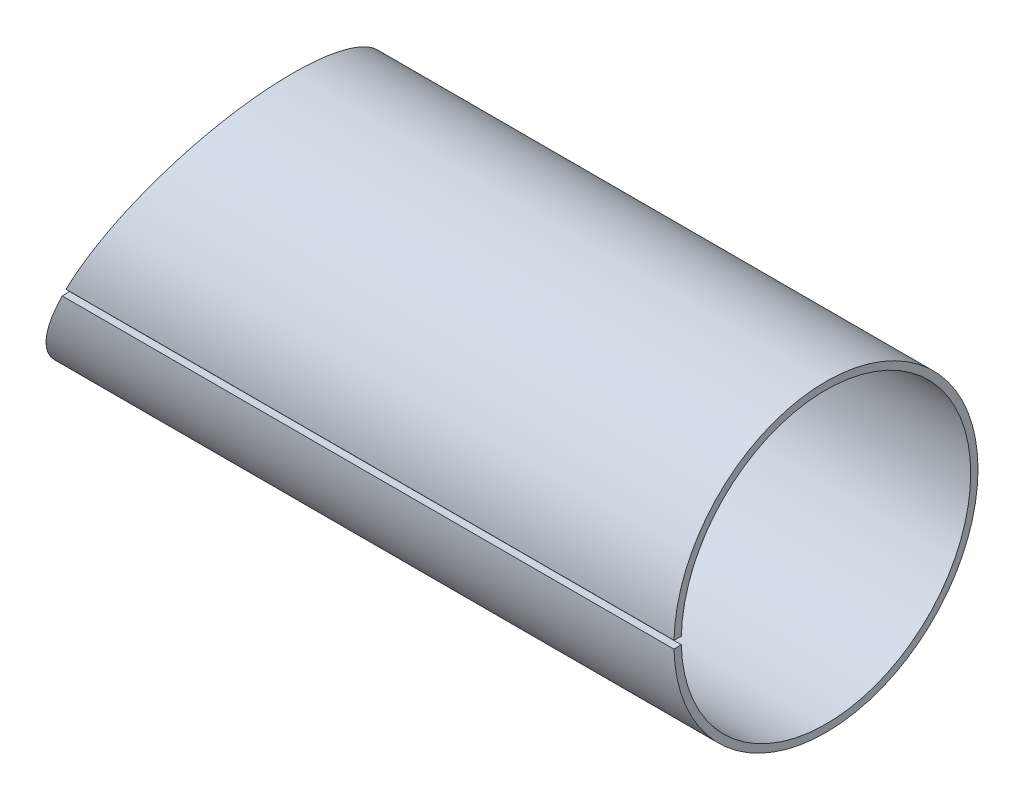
ISO-10303-21;
HEADER;
FILE_DESCRIPTION(('STEP AP214'),'2;1');
FILE_NAME('part.step','',(''),(''),'','','');
FILE_SCHEMA(('AUTOMOTIVE_DESIGN { 1 0 10303 214 1 1 1 1 }'));
ENDSEC;
DATA;
#1=APPLICATION_CONTEXT('core data for automotive mechanical design processes');
#2=APPLICATION_PROTOCOL_DEFINITION('international standard','automotive_design',2000,#1);
#3=PRODUCT_CONTEXT('',#1,'mechanical');
#4=PRODUCT('Part','Part','',(#3));
#5=PRODUCT_RELATED_PRODUCT_CATEGORY('part','',(#4));
#6=PRODUCT_DEFINITION_FORMATION('','',#4);
#7=PRODUCT_DEFINITION_CONTEXT('part definition',#1,'design');
#8=PRODUCT_DEFINITION('design','',#6,#7);
#9=PRODUCT_DEFINITION_SHAPE('','',#8);
#10=(LENGTH_UNIT() NAMED_UNIT(*) SI_UNIT(.MILLI.,.METRE.));
#11=(NAMED_UNIT(*) PLANE_ANGLE_UNIT() SI_UNIT($,.RADIAN.));
#12=(NAMED_UNIT(*) SI_UNIT($,.STERADIAN.) SOLID_ANGLE_UNIT());
#13=UNCERTAINTY_MEASURE_WITH_UNIT(LENGTH_MEASURE(1.E-05),#10,'distance_accuracy_value','');
#14=(GEOMETRIC_REPRESENTATION_CONTEXT(3) GLOBAL_UNCERTAINTY_ASSIGNED_CONTEXT((#13)) GLOBAL_UNIT_ASSIGNED_CONTEXT((#10,
#11,#12)) REPRESENTATION_CONTEXT('',''));
#15=CARTESIAN_POINT('',(0.,0.,0.));
#16=DIRECTION('',(0.,0.,1.));
#17=DIRECTION('',(1.,0.,0.));
#18=AXIS2_PLACEMENT_3D('',#15,#16,#17);
#19=CARTESIAN_POINT('',(83.3860984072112,0.,0.));
#20=DIRECTION('',(-1.,0.,0.));
#21=DIRECTION('',(0.,0.,1.));
#22=AXIS2_PLACEMENT_3D('',#19,#20,#21);
#23=PLANE('',#22);
#24=DIRECTION('',(0.,0.0252703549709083,0.999680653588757));
#25=VECTOR('',#24,1.);
#26=CARTESIAN_POINT('',(83.3860984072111,0.499999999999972,19.7797113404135));
#27=LINE('',#26,#25);
#28=CARTESIAN_POINT('',(83.3860984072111,0.499999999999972,19.7797113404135));
#29=VERTEX_POINT('',#28);
#30=CARTESIAN_POINT('',(83.3860984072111,0.52527035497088,20.7793919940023));
#31=VERTEX_POINT('',#30);
#32=EDGE_CURVE('E13',#29,#31,#27,.T.);
#33=ORIENTED_EDGE('',*,*,#32,.F.);
#34=CARTESIAN_POINT('',(83.3860984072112,0.,0.));
#35=DIRECTION('',(1.,0.,0.));
#36=DIRECTION('',(0.,0.,-1.));
#37=AXIS2_PLACEMENT_3D('',#34,#35,#36);
#38=CIRCLE('',#37,19.786029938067);
#39=CARTESIAN_POINT('',(83.3860984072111,-0.499999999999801,19.7797113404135));
#40=VERTEX_POINT('',#39);
#41=EDGE_CURVE('E79',#40,#29,#38,.T.);
#42=ORIENTED_EDGE('',*,*,#41,.F.);
#43=DIRECTION('',(0.,-0.0252703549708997,0.999680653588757));
#44=VECTOR('',#43,1.);
#45=CARTESIAN_POINT('',(83.3860984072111,-0.499999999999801,19.7797113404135));
#46=LINE('',#45,#44);
#47=CARTESIAN_POINT('',(83.3860984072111,-0.525270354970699,20.7793919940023));
#48=VERTEX_POINT('',#47);
#49=EDGE_CURVE('E48',#40,#48,#46,.T.);
#50=ORIENTED_EDGE('',*,*,#49,.T.);
#51=CARTESIAN_POINT('',(83.3860984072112,0.,0.));
#52=DIRECTION('',(1.,0.,0.));
#53=DIRECTION('',(0.,0.,-1.));
#54=AXIS2_PLACEMENT_3D('',#51,#52,#53);
#55=CIRCLE('',#54,20.786029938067);
#56=EDGE_CURVE('E81',#48,#31,#55,.T.);
#57=ORIENTED_EDGE('',*,*,#56,.T.);
#58=EDGE_LOOP('',(#33,#42,#50,#57));
#59=FACE_BOUND('',#58,.T.);
#60=ADVANCED_FACE('F36',(#59),#23,.F.);
#61=CARTESIAN_POINT('',(41.5612085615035,-0.499999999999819,19.7797113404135));
#62=DIRECTION('',(0.,-0.999680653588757,-0.0252703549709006));
#63=DIRECTION('',(1.,0.,0.));
#64=AXIS2_PLACEMENT_3D('',#61,#62,#63);
#65=PLANE('',#64);
#66=ORIENTED_EDGE('',*,*,#49,.F.);
#67=DIRECTION('',(1.,0.,0.));
#68=VECTOR('',#67,1.);
#69=CARTESIAN_POINT('',(-0.263681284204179,-0.499999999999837,19.7797113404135));
#70=LINE('',#69,#68);
#71=CARTESIAN_POINT('',(-0.263681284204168,-0.499999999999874,19.7797113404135));
#72=VERTEX_POINT('',#71);
#73=EDGE_CURVE('E88',#72,#40,#70,.T.);
#74=ORIENTED_EDGE('',*,*,#73,.F.);
#75=CARTESIAN_POINT('',(-0.263681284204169,-0.525270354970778,20.7793919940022));
#76=CARTESIAN_POINT('',(-0.263681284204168,-0.499999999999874,19.7797113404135));
#77=B_SPLINE_CURVE_WITH_KNOTS('',1,(#75,#76),.UNSPECIFIED.,.F.,.F.,(2,2),(0.,1.),.UNSPECIFIED.);
#78=CARTESIAN_POINT('',(-0.263681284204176,-0.525270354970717,20.7793919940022));
#79=VERTEX_POINT('',#78);
#80=EDGE_CURVE('E154',#72,#79,#77,.F.);
#81=ORIENTED_EDGE('',*,*,#80,.T.);
#82=DIRECTION('',(1.,0.,0.));
#83=VECTOR('',#82,1.);
#84=CARTESIAN_POINT('',(-154.998125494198,-0.525270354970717,20.7793919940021));
#85=LINE('',#84,#83);
#86=EDGE_CURVE('E95',#79,#48,#85,.T.);
#87=ORIENTED_EDGE('',*,*,#86,.T.);
#88=EDGE_LOOP('',(#66,#74,#81,#87));
#89=FACE_BOUND('',#88,.T.);
#90=ADVANCED_FACE('F126',(#89),#65,.F.);
#91=CARTESIAN_POINT('',(0.263681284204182,0.525270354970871,20.7793919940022));
#92=CARTESIAN_POINT('',(0.663519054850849,1.32182740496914,20.7592562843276));
#93=CARTESIAN_POINT('',(1.02061929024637,2.03411045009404,20.6959065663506));
#94=CARTESIAN_POINT('',(1.64972063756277,3.28722495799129,20.5341741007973));
#95=CARTESIAN_POINT('',(1.92165909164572,3.8281126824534,20.4358145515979));
#96=CARTESIAN_POINT('',(2.2083168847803,4.39910667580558,20.3155241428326));
#97=CARTESIAN_POINT('',(2.26437491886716,4.51079887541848,20.2910022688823));
#98=CARTESIAN_POINT('',(2.37612709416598,4.73345775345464,20.2402188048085));
#99=CARTESIAN_POINT('',(2.43147625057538,4.84374487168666,20.2140997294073));
#100=CARTESIAN_POINT('',(2.59594292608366,5.17146397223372,20.1336933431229));
#101=CARTESIAN_POINT('',(2.70347965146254,5.3857525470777,20.0773576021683));
#102=CARTESIAN_POINT('',(3.01976665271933,6.01596674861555,19.9011933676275));
#103=CARTESIAN_POINT('',(3.22219375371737,6.41922512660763,19.7742204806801));
#104=CARTESIAN_POINT('',(3.6101861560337,7.1919656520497,19.5064573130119));
#105=CARTESIAN_POINT('',(3.79575145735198,7.5614512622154,19.3656678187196));
#106=CARTESIAN_POINT('',(4.1500202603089,8.2671076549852,19.0751033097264));
#107=CARTESIAN_POINT('',(4.32138172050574,8.60855514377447,18.9232088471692));
#108=CARTESIAN_POINT('',(4.82268316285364,9.60735896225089,18.4472694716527));
#109=CARTESIAN_POINT('',(5.13790458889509,10.2352759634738,18.104582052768));
#110=CARTESIAN_POINT('',(5.58226742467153,11.1203411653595,17.5646373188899));
#111=CARTESIAN_POINT('',(5.72528860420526,11.4052380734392,17.3807969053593));
#112=CARTESIAN_POINT('',(6.00380039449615,11.9601176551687,17.0037390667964));
#113=CARTESIAN_POINT('',(6.13939615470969,12.2302761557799,16.8103403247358));
#114=CARTESIAN_POINT('',(6.53520303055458,13.0188000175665,16.2173521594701));
#115=CARTESIAN_POINT('',(6.78443374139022,13.5151771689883,15.8049930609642));
#116=CARTESIAN_POINT('',(7.2536140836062,14.4496927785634,14.9554069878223));
#117=CARTESIAN_POINT('',(7.47328513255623,14.8874708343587,14.5188186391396));
#118=CARTESIAN_POINT('',(7.88871610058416,15.7151409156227,13.6186353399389));
#119=CARTESIAN_POINT('',(8.08383213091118,16.1037564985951,13.1560971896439));
#120=CARTESIAN_POINT('',(8.44886528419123,16.8307472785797,12.2122812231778));
#121=CARTESIAN_POINT('',(8.61842621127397,17.1685352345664,11.7319806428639));
#122=CARTESIAN_POINT('',(8.93447333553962,17.79828726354,10.7526249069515));
#123=CARTESIAN_POINT('',(9.08096612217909,18.0901613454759,10.2534742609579));
#124=CARTESIAN_POINT('',(9.35089014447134,18.62779994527,9.24081928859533));
#125=CARTESIAN_POINT('',(9.47432138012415,18.8735657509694,8.7273161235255));
#126=CARTESIAN_POINT('',(9.69812230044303,19.3193126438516,7.6903634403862));
#127=CARTESIAN_POINT('',(9.79879639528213,19.5200968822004,7.16515442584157));
#128=CARTESIAN_POINT('',(10.0678942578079,20.0570853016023,5.57051958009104));
#129=CARTESIAN_POINT('',(10.20307630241,20.3269719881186,4.48394742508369));
#130=CARTESIAN_POINT('',(10.3850073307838,20.6889471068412,2.29326019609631));
#131=CARTESIAN_POINT('',(10.4317563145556,20.7810474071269,1.18917022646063));
#132=CARTESIAN_POINT('',(10.4355549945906,20.7882254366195,-0.45877873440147));
#133=CARTESIAN_POINT('',(10.4257914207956,20.7688920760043,-1.00726015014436));
#134=CARTESIAN_POINT('',(10.3844381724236,20.6865797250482,-2.1040129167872));
#135=CARTESIAN_POINT('',(10.3528155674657,20.6235875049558,-2.65158975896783));
#136=CARTESIAN_POINT('',(10.2251098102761,20.3691067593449,-4.28666856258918));
#137=CARTESIAN_POINT('',(10.0962994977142,20.1126399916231,-5.36564871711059));
#138=CARTESIAN_POINT('',(9.8359643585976,19.594085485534,-6.96011586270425));
#139=CARTESIAN_POINT('',(9.73805641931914,19.3989975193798,-7.48705586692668));
#140=CARTESIAN_POINT('',(9.51998142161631,18.9644705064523,-8.5279521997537));
#141=CARTESIAN_POINT('',(9.39985555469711,18.7251824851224,-9.04178004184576));
#142=CARTESIAN_POINT('',(9.13593136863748,18.1995708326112,-10.0579255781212));
#143=CARTESIAN_POINT('',(8.99230767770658,17.9135195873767,-10.5595161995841));
#144=CARTESIAN_POINT('',(8.68173710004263,17.2947823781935,-11.545045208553));
#145=CARTESIAN_POINT('',(8.51512940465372,16.9627332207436,-12.0281586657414));
#146=CARTESIAN_POINT('',(7.97778769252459,15.892378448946,-13.449864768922));
#147=CARTESIAN_POINT('',(7.56830328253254,15.0768611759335,-14.3638329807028));
#148=CARTESIAN_POINT('',(6.64682125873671,13.2407573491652,-16.0721431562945));
#149=CARTESIAN_POINT('',(6.12578866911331,12.203206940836,-16.8822935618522));
#150=CARTESIAN_POINT('',(5.2532861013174,10.4650061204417,-17.9724915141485));
#151=CARTESIAN_POINT('',(4.94315623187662,9.84740762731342,-18.3201010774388));
#152=CARTESIAN_POINT('',(4.44757139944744,8.86007478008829,-18.8067206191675));
#153=CARTESIAN_POINT('',(4.2773903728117,8.52098109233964,-18.9630166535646));
#154=CARTESIAN_POINT('',(4.01463970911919,7.99746326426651,-19.1868611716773));
#155=CARTESIAN_POINT('',(3.92580963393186,7.82047928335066,-19.2597086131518));
#156=CARTESIAN_POINT('',(3.74565644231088,7.46159046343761,-19.4015705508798));
#157=CARTESIAN_POINT('',(3.6541651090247,7.27936388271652,-19.4707413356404));
#158=CARTESIAN_POINT('',(3.18293730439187,6.34093869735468,-19.8113451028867));
#159=CARTESIAN_POINT('',(2.76773411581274,5.51396067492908,-20.0627491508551));
#160=CARTESIAN_POINT('',(2.20095394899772,4.38453639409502,-20.3196590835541));
#161=CARTESIAN_POINT('',(2.08520910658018,4.15389133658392,-20.3681531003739));
#162=CARTESIAN_POINT('',(1.93754204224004,3.85969686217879,-20.4246265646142));
#163=CARTESIAN_POINT('',(1.90817578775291,3.80118784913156,-20.4356016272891));
#164=CARTESIAN_POINT('',(1.84726409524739,3.67987479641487,-20.4577947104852));
#165=CARTESIAN_POINT('',(1.81570937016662,3.6170510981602,-20.4690091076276));
#166=CARTESIAN_POINT('',(1.71774855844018,3.42205517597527,-20.502828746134));
#167=CARTESIAN_POINT('',(1.64804583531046,3.28335741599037,-20.5256145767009));
#168=CARTESIAN_POINT('',(1.27755464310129,2.54608736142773,-20.6381313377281));
#169=CARTESIAN_POINT('',(0.910833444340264,1.81562061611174,-20.7249445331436));
#170=CARTESIAN_POINT('',(0.364521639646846,0.726474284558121,-20.7744752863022));
#171=CARTESIAN_POINT('',(0.250863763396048,0.499882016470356,-20.7813501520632));
#172=CARTESIAN_POINT('',(0.0737836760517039,0.146994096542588,-20.785843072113));
#173=CARTESIAN_POINT('',(0.0129622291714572,0.0258358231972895,-20.7863585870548));
#174=CARTESIAN_POINT('',(-0.10720413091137,-0.213579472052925,-20.7852773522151));
#175=CARTESIAN_POINT('',(-0.166192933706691,-0.331138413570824,-20.7837126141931));
#176=CARTESIAN_POINT('',(-0.455665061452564,-0.908112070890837,-20.7713149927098));
#177=CARTESIAN_POINT('',(-0.669732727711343,-1.33500490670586,-20.7468387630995));
#178=CARTESIAN_POINT('',(-1.25940561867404,-2.5101852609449,-20.6488758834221));
#179=CARTESIAN_POINT('',(-1.58248073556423,-3.15272028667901,-20.5519173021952));
#180=CARTESIAN_POINT('',(-1.86714508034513,-3.71948433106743,-20.4506373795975));
#181=CARTESIAN_POINT('',(-1.89740042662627,-3.77974495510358,-20.439575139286));
#182=CARTESIAN_POINT('',(-1.95712025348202,-3.89871122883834,-20.417217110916));
#183=CARTESIAN_POINT('',(-1.98682999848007,-3.95789910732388,-20.4058246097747));
#184=CARTESIAN_POINT('',(-2.07550872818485,-4.13457395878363,-20.371027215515));
#185=CARTESIAN_POINT('',(-2.13402720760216,-4.25117204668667,-20.3470024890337));
#186=CARTESIAN_POINT('',(-2.30778062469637,-4.59739051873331,-20.2726114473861));
#187=CARTESIAN_POINT('',(-2.42121354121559,-4.82343361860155,-20.2199292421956));
#188=CARTESIAN_POINT('',(-2.75430420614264,-5.48714870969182,-20.0538843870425));
#189=CARTESIAN_POINT('',(-2.96675386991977,-5.91038648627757,-19.9325403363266));
#190=CARTESIAN_POINT('',(-3.37243163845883,-6.7183481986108,-19.6749238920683));
#191=CARTESIAN_POINT('',(-3.56565974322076,-7.10307702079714,-19.5386525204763));
#192=CARTESIAN_POINT('',(-3.93289439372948,-7.83457653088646,-19.2570001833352));
#193=CARTESIAN_POINT('',(-4.11101290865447,-8.18950128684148,-19.1084939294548));
#194=CARTESIAN_POINT('',(-4.63094348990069,-9.225475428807,-18.6419786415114));
#195=CARTESIAN_POINT('',(-4.95742214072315,-9.87583888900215,-18.3037206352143));
#196=CARTESIAN_POINT('',(-5.41692751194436,-10.7910399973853,-17.7689991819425));
#197=CARTESIAN_POINT('',(-5.56471057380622,-11.0854055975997,-17.5866575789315));
#198=CARTESIAN_POINT('',(-5.85301592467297,-11.6597501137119,-17.2112454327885));
#199=CARTESIAN_POINT('',(-5.99331721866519,-11.9392632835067,-17.0183975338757));
#200=CARTESIAN_POINT('',(-6.40266695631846,-12.7547181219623,-16.4264266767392));
#201=CARTESIAN_POINT('',(-6.66016125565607,-13.2675340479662,-16.0139024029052));
#202=CARTESIAN_POINT('',(-7.02329441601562,-13.9908988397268,-15.3758629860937));
#203=CARTESIAN_POINT('',(-7.14032336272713,-14.2241014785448,-15.1602629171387));
#204=CARTESIAN_POINT('',(-7.36801001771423,-14.677782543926,-14.7214582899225));
#205=CARTESIAN_POINT('',(-7.47856107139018,-14.8980477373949,-14.4984157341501));
#206=CARTESIAN_POINT('',(-7.80033741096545,-15.5390763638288,-13.8196788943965));
#207=CARTESIAN_POINT('',(-8.00168587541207,-15.9400493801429,-13.3543892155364));
#208=CARTESIAN_POINT('',(-8.37804461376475,-16.6896171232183,-12.4049008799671));
#209=CARTESIAN_POINT('',(-8.55277250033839,-17.0378163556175,-11.9214660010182));
#210=CARTESIAN_POINT('',(-8.87901380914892,-17.6878517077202,-10.9338209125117));
#211=CARTESIAN_POINT('',(-9.03019674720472,-17.9890098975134,-10.4303519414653));
#212=CARTESIAN_POINT('',(-9.44793241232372,-18.8209640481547,-8.89837431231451));
#213=CARTESIAN_POINT('',(-9.67831114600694,-19.2800001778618,-7.85012327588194));
#214=CARTESIAN_POINT('',(-9.95654956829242,-19.8342887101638,-6.24347518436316));
#215=CARTESIAN_POINT('',(-10.0379064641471,-19.9962971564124,-5.7028276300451));
#216=CARTESIAN_POINT('',(-10.1778417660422,-20.2749440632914,-4.61527747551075));
#217=CARTESIAN_POINT('',(-10.2364092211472,-20.3916217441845,-4.06848643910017));
#218=CARTESIAN_POINT('',(-10.378686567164,-20.6751457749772,-2.41754058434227));
#219=CARTESIAN_POINT('',(-10.4287234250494,-20.7746907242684,-1.30539621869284));
#220=CARTESIAN_POINT('',(-10.4391801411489,-20.7955372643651,0.915130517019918));
#221=CARTESIAN_POINT('',(-10.3996307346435,-20.7168325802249,2.02880535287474));
#222=CARTESIAN_POINT('',(-10.273139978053,-20.4647690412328,3.68283984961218));
#223=CARTESIAN_POINT('',(-10.2198225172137,-20.3585833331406,4.23100499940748));
#224=CARTESIAN_POINT('',(-10.0904248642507,-20.1009304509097,5.32220947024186));
#225=CARTESIAN_POINT('',(-10.0143797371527,-19.9494852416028,5.86485931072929));
#226=CARTESIAN_POINT('',(-9.75220545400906,-19.4271617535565,7.47812870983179));
#227=CARTESIAN_POINT('',(-9.53253652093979,-18.9895424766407,8.53209948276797));
#228=CARTESIAN_POINT('',(-9.13150895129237,-18.1908092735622,10.0741550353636));
#229=CARTESIAN_POINT('',(-8.986020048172,-17.9009637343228,10.5811314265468));
#230=CARTESIAN_POINT('',(-8.67141614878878,-17.2741157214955,11.576258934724));
#231=CARTESIAN_POINT('',(-8.50248292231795,-16.9375396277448,12.0639968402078));
#232=CARTESIAN_POINT('',(-8.13827184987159,-16.2121701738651,13.0225115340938));
#233=CARTESIAN_POINT('',(-7.94330893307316,-15.8238694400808,13.4923979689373));
#234=CARTESIAN_POINT('',(-7.52766833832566,-14.9958064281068,14.407131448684));
#235=CARTESIAN_POINT('',(-7.30770867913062,-14.5574459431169,14.8507567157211));
#236=CARTESIAN_POINT('',(-6.83779396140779,-13.6214763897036,15.7136752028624));
#237=CARTESIAN_POINT('',(-6.58782496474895,-13.1236716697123,16.132843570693));
#238=CARTESIAN_POINT('',(-6.19035401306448,-12.331851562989,16.7360260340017));
#239=CARTESIAN_POINT('',(-6.05411078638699,-12.0604021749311,16.9328192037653));
#240=CARTESIAN_POINT('',(-5.77411851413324,-11.5025439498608,17.3166148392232));
#241=CARTESIAN_POINT('',(-5.63051188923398,-11.2164391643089,17.50348504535));
#242=CARTESIAN_POINT('',(-5.18387679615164,-10.3268238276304,18.0527441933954));
#243=CARTESIAN_POINT('',(-4.8665026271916,-9.69467069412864,18.4018447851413));
#244=CARTESIAN_POINT('',(-4.36101521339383,-8.68753284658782,18.8871566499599));
#245=CARTESIAN_POINT('',(-4.18765267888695,-8.34209640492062,19.042493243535));
#246=CARTESIAN_POINT('',(-3.83096780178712,-7.63155275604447,19.338214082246));
#247=CARTESIAN_POINT('',(-3.64392060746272,-7.25911503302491,19.4816558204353));
#248=CARTESIAN_POINT('',(-3.05666475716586,-6.08953996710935,19.8911799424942));
#249=CARTESIAN_POINT('',(-2.63034183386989,-5.2398300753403,20.1366636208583));
#250=CARTESIAN_POINT('',(-1.93862891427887,-3.86188428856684,20.4295225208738));
#251=CARTESIAN_POINT('',(-1.66486986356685,-3.31739444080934,20.5295128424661));
#252=CARTESIAN_POINT('',(-1.02969732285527,-2.05220929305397,20.6943093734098));
#253=CARTESIAN_POINT('',(-0.668562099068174,-1.3318718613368,20.759002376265));
#254=CARTESIAN_POINT('',(-0.263681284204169,-0.525270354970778,20.7793919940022));
#255=CARTESIAN_POINT('',(0.263681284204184,0.499999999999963,19.7797113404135));
#256=CARTESIAN_POINT('',(0.663517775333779,1.25823287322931,19.7605444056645));
#257=CARTESIAN_POINT('',(1.02061929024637,1.93625095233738,19.7002423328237));
#258=CARTESIAN_POINT('',(1.64972063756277,3.12907907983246,19.5462906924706));
#259=CARTESIAN_POINT('',(1.92165909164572,3.64394510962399,19.4526631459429));
#260=CARTESIAN_POINT('',(2.2083168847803,4.18746901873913,19.3381598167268));
#261=CARTESIAN_POINT('',(2.26437491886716,4.29378779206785,19.3148176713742));
#262=CARTESIAN_POINT('',(2.37612709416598,4.5057347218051,19.2664773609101));
#263=CARTESIAN_POINT('',(2.43147625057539,4.61071601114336,19.2416148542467));
#264=CARTESIAN_POINT('',(2.59594292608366,4.92266879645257,19.1650767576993));
#265=CARTESIAN_POINT('',(2.70347965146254,5.12664811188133,19.1114512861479));
#266=CARTESIAN_POINT('',(3.01976665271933,5.72654319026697,18.9437621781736));
#267=CARTESIAN_POINT('',(3.22219375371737,6.11040111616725,18.8228978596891));
#268=CARTESIAN_POINT('',(3.6101861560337,6.84596568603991,18.5680165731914));
#269=CARTESIAN_POINT('',(3.79575145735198,7.19767562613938,18.4340003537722));
#270=CARTESIAN_POINT('',(4.1500202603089,7.86938342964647,18.1574146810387));
#271=CARTESIAN_POINT('',(4.32138172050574,8.19440414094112,18.0128277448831));
#272=CARTESIAN_POINT('',(4.82268316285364,9.14515627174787,17.5597854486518));
#273=CARTESIAN_POINT('',(5.13790458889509,9.74286466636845,17.2335844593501));
#274=CARTESIAN_POINT('',(5.58226742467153,10.5853500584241,16.719616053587));
#275=CARTESIAN_POINT('',(5.72528860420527,10.8565407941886,16.5446200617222));
#276=CARTESIAN_POINT('',(6.00380039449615,11.3847255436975,16.1857021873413));
#277=CARTESIAN_POINT('',(6.1393961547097,11.6418869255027,16.0016077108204));
#278=CARTESIAN_POINT('',(6.53520303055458,12.3924755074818,15.4371477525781));
#279=CARTESIAN_POINT('',(6.78443374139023,12.8649723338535,15.0446269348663));
#280=CARTESIAN_POINT('',(7.2536140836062,13.7545291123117,14.2359137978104));
#281=CARTESIAN_POINT('',(7.47328513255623,14.1712460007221,13.8203293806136));
#282=CARTESIAN_POINT('',(7.88871610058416,14.9590975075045,12.9634532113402));
#283=CARTESIAN_POINT('',(8.08383213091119,15.3290170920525,12.5231674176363));
#284=CARTESIAN_POINT('',(8.44886528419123,16.0210329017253,11.6247577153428));
#285=CARTESIAN_POINT('',(8.61842621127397,16.3425701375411,11.1675640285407));
#286=CARTESIAN_POINT('',(8.93447333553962,16.942025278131,10.2353243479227));
#287=CARTESIAN_POINT('',(9.08096612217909,17.2198575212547,9.7601874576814));
#288=CARTESIAN_POINT('',(9.35089014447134,17.7316307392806,8.79625054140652));
#289=CARTESIAN_POINT('',(9.47432138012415,17.9655729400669,8.30745162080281));
#290=CARTESIAN_POINT('',(9.69812230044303,18.3898752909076,7.32038593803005));
#291=CARTESIAN_POINT('',(9.79879639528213,18.5809999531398,6.82044432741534));
#292=CARTESIAN_POINT('',(10.0678942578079,19.0921542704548,5.30252614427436));
#293=CARTESIAN_POINT('',(10.20307630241,19.3490569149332,4.26822814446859));
#294=CARTESIAN_POINT('',(10.3850073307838,19.6936176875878,2.18293320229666));
#295=CARTESIAN_POINT('',(10.4317563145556,19.7812871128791,1.13196015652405));
#296=CARTESIAN_POINT('',(10.4355549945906,19.7881198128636,-0.436707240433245));
#297=CARTESIAN_POINT('',(10.4257914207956,19.7697165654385,-0.958801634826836));
#298=CARTESIAN_POINT('',(10.3844381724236,19.6913641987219,-2.00279046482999));
#299=CARTESIAN_POINT('',(10.3528155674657,19.6314024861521,-2.52402380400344));
#300=CARTESIAN_POINT('',(10.2251098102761,19.3891646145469,-4.08044021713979));
#301=CARTESIAN_POINT('',(10.0962994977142,19.1450362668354,-5.10751146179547));
#302=CARTESIAN_POINT('',(9.8359643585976,18.6514290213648,-6.62527001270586));
#303=CARTESIAN_POINT('',(9.73805641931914,18.4657265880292,-7.12685933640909));
#304=CARTESIAN_POINT('',(9.51998142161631,18.0521043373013,-8.11767894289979));
#305=CARTESIAN_POINT('',(9.39985555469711,17.8243282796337,-8.60678692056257));
#306=CARTESIAN_POINT('',(9.13593136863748,17.3240034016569,-9.57404647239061));
#307=CARTESIAN_POINT('',(8.99230767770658,17.0517138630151,-10.0515059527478));
#308=CARTESIAN_POINT('',(8.68173710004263,16.4627436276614,-10.9896219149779));
#309=CARTESIAN_POINT('',(8.51512940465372,16.1466691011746,-11.4494931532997));
#310=CARTESIAN_POINT('',(7.97778769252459,15.1278082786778,-12.8028020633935));
#311=CARTESIAN_POINT('',(7.56830328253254,14.3515249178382,-13.6727999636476));
#312=CARTESIAN_POINT('',(6.64682125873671,12.603754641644,-15.2989246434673));
#313=CARTESIAN_POINT('',(6.12578866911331,11.6161199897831,-16.07009933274));
#314=CARTESIAN_POINT('',(5.25328610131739,9.96154268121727,-17.1078486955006));
#315=CARTESIAN_POINT('',(4.94315623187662,9.37365637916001,-17.4387350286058));
#316=CARTESIAN_POINT('',(4.44757139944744,8.43382335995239,-17.9019436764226));
#317=CARTESIAN_POINT('',(4.2773903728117,8.11104321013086,-18.0507204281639));
#318=CARTESIAN_POINT('',(4.01463970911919,7.61271142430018,-18.2637959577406));
#319=CARTESIAN_POINT('',(3.92580963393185,7.4442420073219,-18.3331387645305));
#320=CARTESIAN_POINT('',(3.74565644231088,7.10261905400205,-18.4681758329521));
#321=CARTESIAN_POINT('',(3.6541651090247,6.92915925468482,-18.5340188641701));
#322=CARTESIAN_POINT('',(3.18293730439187,6.03588098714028,-18.8582364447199));
#323=CARTESIAN_POINT('',(2.76773411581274,5.24868824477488,-19.0975456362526));
#324=CARTESIAN_POINT('',(2.20095394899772,4.17359970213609,-19.3420958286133));
#325=CARTESIAN_POINT('',(2.08520910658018,3.95405080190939,-19.3882568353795));
#326=CARTESIAN_POINT('',(1.93754204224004,3.67400979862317,-19.4420134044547));
#327=CARTESIAN_POINT('',(1.9081757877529,3.61831560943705,-19.4524604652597));
#328=CARTESIAN_POINT('',(1.84726409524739,3.50283883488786,-19.4735858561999));
#329=CARTESIAN_POINT('',(1.81570937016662,3.44303753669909,-19.4842607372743));
#330=CARTESIAN_POINT('',(1.71774855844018,3.25742271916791,-19.5164533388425));
#331=CARTESIAN_POINT('',(1.64804583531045,3.12539760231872,-19.5381429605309));
#332=CARTESIAN_POINT('',(1.27755464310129,2.4235970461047,-19.645246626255));
#333=CARTESIAN_POINT('',(0.910833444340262,1.72827249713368,-19.7278833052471));
#334=CARTESIAN_POINT('',(0.364521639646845,0.69152416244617,-19.7750311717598));
#335=CARTESIAN_POINT('',(0.250863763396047,0.475833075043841,-19.7815752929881));
#336=CARTESIAN_POINT('',(0.0737836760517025,0.139922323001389,-19.7858520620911));
#337=CARTESIAN_POINT('',(0.0129622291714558,0.024592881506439,-19.7863427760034));
#338=CARTESIAN_POINT('',(-0.107204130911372,-0.203304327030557,-19.7853135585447));
#339=CARTESIAN_POINT('',(-0.166192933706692,-0.315207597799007,-19.783824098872));
#340=CARTESIAN_POINT('',(-0.455665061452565,-0.864423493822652,-19.7720229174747));
#341=CARTESIAN_POINT('',(-0.669732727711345,-1.27077884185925,-19.7487242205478));
#342=CARTESIAN_POINT('',(-1.25940561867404,-2.38942216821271,-19.6554742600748));
#343=CARTESIAN_POINT('',(-1.58248073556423,-3.00104532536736,-19.563180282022));
#344=CARTESIAN_POINT('',(-1.86714508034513,-3.54054278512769,-19.4667728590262));
#345=CARTESIAN_POINT('',(-1.89740042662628,-3.59790431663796,-19.456242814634));
#346=CARTESIAN_POINT('',(-1.95712025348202,-3.71114721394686,-19.434960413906));
#347=CARTESIAN_POINT('',(-1.98682999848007,-3.76748760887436,-19.4241159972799));
#348=CARTESIAN_POINT('',(-2.07550872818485,-3.93566276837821,-19.3909926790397));
#349=CARTESIAN_POINT('',(-2.13402720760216,-4.04665141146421,-19.3681237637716));
#350=CARTESIAN_POINT('',(-2.30778062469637,-4.37621357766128,-19.2973116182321));
#351=CARTESIAN_POINT('',(-2.42121354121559,-4.59138191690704,-19.2471639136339));
#352=CARTESIAN_POINT('',(-2.75430420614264,-5.22316618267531,-19.0891073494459));
#353=CARTESIAN_POINT('',(-2.96675386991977,-5.62604231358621,-18.9736010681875));
#354=CARTESIAN_POINT('',(-3.37243163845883,-6.39513360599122,-18.7283783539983));
#355=CARTESIAN_POINT('',(-3.56565974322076,-6.76135341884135,-18.5986628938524));
#356=CARTESIAN_POINT('',(-3.93289439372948,-7.45766104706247,-18.3305606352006));
#357=CARTESIAN_POINT('',(-4.11101290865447,-7.79551064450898,-18.1891989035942));
#358=CARTESIAN_POINT('',(-4.63094348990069,-8.7816448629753,-17.7451273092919));
#359=CARTESIAN_POINT('',(-4.95742214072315,-9.40071983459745,-17.4231426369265));
#360=CARTESIAN_POINT('',(-5.41692751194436,-10.2718913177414,-16.9141462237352));
#361=CARTESIAN_POINT('',(-5.56471057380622,-10.5520952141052,-16.7405769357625));
#362=CARTESIAN_POINT('',(-5.85301592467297,-11.0988084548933,-16.383225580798));
#363=CARTESIAN_POINT('',(-5.99331721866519,-11.3648744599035,-16.1996554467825));
#364=CARTESIAN_POINT('',(-6.40266695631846,-12.1410983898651,-15.6361638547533));
#365=CARTESIAN_POINT('',(-6.66016125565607,-12.6292431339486,-15.2434858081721));
#366=CARTESIAN_POINT('',(-7.02329441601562,-13.3178073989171,-14.6361419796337));
#367=CARTESIAN_POINT('',(-7.14032336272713,-13.5397908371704,-14.4309142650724));
#368=CARTESIAN_POINT('',(-7.36801001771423,-13.9716456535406,-14.013220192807));
#369=CARTESIAN_POINT('',(-7.47856107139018,-14.181314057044,-13.8009080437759));
#370=CARTESIAN_POINT('',(-7.80033741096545,-14.7915032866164,-13.1548247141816));
#371=CARTESIAN_POINT('',(-8.00168587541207,-15.1731857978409,-12.7119197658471));
#372=CARTESIAN_POINT('',(-8.37804461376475,-15.8866924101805,-11.8081105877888));
#373=CARTESIAN_POINT('',(-8.55277250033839,-16.2181400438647,-11.3479333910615));
#374=CARTESIAN_POINT('',(-8.87901380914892,-16.8369026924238,-10.4078031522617));
#375=CARTESIAN_POINT('',(-9.03019674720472,-17.1235723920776,-9.9285556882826));
#376=CARTESIAN_POINT('',(-9.44793241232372,-17.9155018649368,-8.47028033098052));
#377=CARTESIAN_POINT('',(-9.67831114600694,-18.3524541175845,-7.47245985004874));
#378=CARTESIAN_POINT('',(-9.95654956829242,-18.8800762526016,-5.94310636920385));
#379=CARTESIAN_POINT('',(-10.0379064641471,-19.03429059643,-5.42846895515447));
#380=CARTESIAN_POINT('',(-10.1778417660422,-19.2995320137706,-4.39324000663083));
#381=CARTESIAN_POINT('',(-10.2364092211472,-19.4105964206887,-3.87275466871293));
#382=CARTESIAN_POINT('',(-10.378686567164,-19.6804803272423,-2.30123455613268));
#383=CARTESIAN_POINT('',(-10.4287234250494,-19.7752362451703,-1.24259460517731));
#384=CARTESIAN_POINT('',(-10.4391801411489,-19.7950798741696,0.871104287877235));
#385=CARTESIAN_POINT('',(-10.3996307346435,-19.720161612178,1.93120107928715));
#386=CARTESIAN_POINT('',(-10.273139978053,-19.4802246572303,3.50566124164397));
#387=CARTESIAN_POINT('',(-10.2198225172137,-19.3791474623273,4.02745458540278));
#388=CARTESIAN_POINT('',(-10.0904248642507,-19.1338900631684,5.06616204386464));
#389=CARTESIAN_POINT('',(-10.0143797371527,-18.989730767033,5.58270541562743));
#390=CARTESIAN_POINT('',(-9.75220545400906,-18.492535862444,7.11836165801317));
#391=CARTESIAN_POINT('',(-9.53253652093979,-18.0759701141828,8.12162670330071));
#392=CARTESIAN_POINT('',(-9.13150895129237,-17.3156633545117,9.58949514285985));
#393=CARTESIAN_POINT('',(-8.986020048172,-17.039762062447,10.0720812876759));
#394=CARTESIAN_POINT('',(-8.67141614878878,-16.443071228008,11.0193339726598));
#395=CARTESIAN_POINT('',(-8.50248292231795,-16.1226875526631,11.483607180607));
#396=CARTESIAN_POINT('',(-8.13827184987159,-15.4322150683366,12.3960084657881));
#397=CARTESIAN_POINT('',(-7.94330893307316,-15.0625951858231,12.8432890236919));
#398=CARTESIAN_POINT('',(-7.52766833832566,-14.2743696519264,13.7140153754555));
#399=CARTESIAN_POINT('',(-7.30770867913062,-13.8570983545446,14.1362981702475));
#400=CARTESIAN_POINT('',(-6.83779396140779,-12.966157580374,14.957702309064));
#401=CARTESIAN_POINT('',(-6.58782496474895,-12.4923018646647,15.356704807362));
#402=CARTESIAN_POINT('',(-6.19035401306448,-11.7385756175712,15.9308686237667));
#403=CARTESIAN_POINT('',(-6.05411078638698,-11.4801854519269,16.1181942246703));
#404=CARTESIAN_POINT('',(-5.77411851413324,-10.9491653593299,16.4835257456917));
#405=CARTESIAN_POINT('',(-5.63051188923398,-10.6768248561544,16.6614057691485));
#406=CARTESIAN_POINT('',(-5.18387679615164,-9.83000823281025,17.1842404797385));
#407=CARTESIAN_POINT('',(-4.8665026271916,-9.22826750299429,17.5165461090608));
#408=CARTESIAN_POINT('',(-4.36101521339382,-8.26958228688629,17.9785099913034));
#409=CARTESIAN_POINT('',(-4.18765267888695,-7.94076452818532,18.1263734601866));
#410=CARTESIAN_POINT('',(-3.83096780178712,-7.26440459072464,18.4078673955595));
#411=CARTESIAN_POINT('',(-3.64392060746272,-6.90988456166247,18.5444082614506));
#412=CARTESIAN_POINT('',(-3.05666475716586,-5.79657685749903,18.9342304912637));
#413=CARTESIAN_POINT('',(-2.63034183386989,-4.98774585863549,19.167904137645));
#414=CARTESIAN_POINT('',(-1.93862891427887,-3.67609198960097,19.4466738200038));
#415=CARTESIAN_POINT('',(-1.66486986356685,-3.15779713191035,19.5418536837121));
#416=CARTESIAN_POINT('',(-1.02969732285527,-1.95347907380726,19.6987219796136));
#417=CARTESIAN_POINT('',(-0.668560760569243,-1.2677939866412,19.7603027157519));
#418=CARTESIAN_POINT('',(-0.263681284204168,-0.499999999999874,19.7797113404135));
#419=B_SPLINE_SURFACE_WITH_KNOTS('',1,3,((#91,#92,#93,#94,#95,#96,#97,#98,#99,#100,#101,#102,
#103,#104,#105,#106,#107,#108,#109,#110,#111,#112,#113,#114,#115,#116,#117,#118,#119,#120,#121,
#122,#123,#124,#125,#126,#127,#128,#129,#130,#131,#132,#133,#134,#135,#136,#137,#138,#139,#140,
#141,#142,#143,#144,#145,#146,#147,#148,#149,#150,#151,#152,#153,#154,#155,#156,#157,#158,#159,
#160,#161,#162,#163,#164,#165,#166,#167,#168,#169,#170,#171,#172,#173,#174,#175,#176,#177,#178,
#179,#180,#181,#182,#183,#184,#185,#186,#187,#188,#189,#190,#191,#192,#193,#194,#195,#196,#197,
#198,#199,#200,#201,#202,#203,#204,#205,#206,#207,#208,#209,#210,#211,#212,#213,#214,#215,#216,
#217,#218,#219,#220,#221,#222,#223,#224,#225,#226,#227,#228,#229,#230,#231,#232,#233,#234,#235,
#236,#237,#238,#239,#240,#241,#242,#243,#244,#245,#246,#247,#248,#249,#250,#251,#252,#253,#254),
(#255,#256,#257,#258,#259,#260,#261,#262,#263,#264,#265,#266,#267,#268,#269,#270,#271,#272,#273,
#274,#275,#276,#277,#278,#279,#280,#281,#282,#283,#284,#285,#286,#287,#288,#289,#290,#291,#292,
#293,#294,#295,#296,#297,#298,#299,#300,#301,#302,#303,#304,#305,#306,#307,#308,#309,#310,#311,
#312,#313,#314,#315,#316,#317,#318,#319,#320,#321,#322,#323,#324,#325,#326,#327,#328,#329,#330,
#331,#332,#333,#334,#335,#336,#337,#338,#339,#340,#341,#342,#343,#344,#345,#346,#347,#348,#349,
#350,#351,#352,#353,#354,#355,#356,#357,#358,#359,#360,#361,#362,#363,#364,#365,#366,#367,#368,
#369,#370,#371,#372,#373,#374,#375,#376,#377,#378,#379,#380,#381,#382,#383,#384,#385,#386,#387,
#388,#389,#390,#391,#392,#393,#394,#395,#396,#397,#398,#399,#400,#401,#402,#403,#404,#405,#406,
#407,#408,#409,#410,#411,#412,#413,#414,#415,#416,#417,#418)),.UNSPECIFIED.,.F.,.F.,.F.,(2,2),
(4,2,2,2,2,2,2,2,2,2,2,2,2,2,2,2,2,2,2,2,2,2,2,2,2,2,2,2,2,2,2,2,2,2,2,2,2,2,2,2,2,2,2,2,2,2,2,
2,2,2,2,2,2,2,2,2,2,2,2,2,2,2,2,2,2,2,2,2,2,2,2,2,2,2,2,2,2,2,2,2,2,4),(0.,1.),(0.,0.0078125,
0.015625,0.017578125,0.01953125,0.0234375,0.03125,0.0390625,0.046875,0.0625,0.0703125,0.078125,
0.09375,0.109375,0.125,0.140625,0.15625,0.171875,0.1875,0.21875,0.25,0.265625,0.28125,0.3125,
0.328125,0.34375,0.359375,0.375,0.40625,0.4375,0.453125,0.4609375,0.46484375,0.46875,0.484375,
0.48828125,0.4892578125,0.490234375,0.4921875,0.5,0.501953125,0.5029296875,0.50390625,0.5078125,
0.515625,0.5166015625,0.517578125,0.51953125,0.5234375,0.53125,0.5390625,0.546875,0.5625,
0.5703125,0.578125,0.59375,0.6015625,0.609375,0.625,0.640625,0.65625,0.6875,0.703125,0.71875,
0.75,0.78125,0.796875,0.8125,0.84375,0.859375,0.875,0.890625,0.90625,0.921875,0.9296875,0.9375,
0.953125,0.9609375,0.96875,0.984375,0.9921875,1.),.UNSPECIFIED.);
#420=CARTESIAN_POINT('',(-0.263681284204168,-0.499999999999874,19.7797113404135));
#421=CARTESIAN_POINT('',(-0.668560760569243,-1.2677939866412,19.7603027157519));
#422=CARTESIAN_POINT('',(-1.02969732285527,-1.95347907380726,19.6987219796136));
#423=CARTESIAN_POINT('',(-1.66486986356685,-3.15779713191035,19.5418536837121));
#424=CARTESIAN_POINT('',(-1.93862891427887,-3.67609198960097,19.4466738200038));
#425=CARTESIAN_POINT('',(-2.63034183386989,-4.98774585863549,19.167904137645));
#426=CARTESIAN_POINT('',(-3.05666475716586,-5.79657685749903,18.9342304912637));
#427=CARTESIAN_POINT('',(-3.64392060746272,-6.90988456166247,18.5444082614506));
#428=CARTESIAN_POINT('',(-3.83096780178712,-7.26440459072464,18.4078673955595));
#429=CARTESIAN_POINT('',(-4.18765267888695,-7.94076452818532,18.1263734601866));
#430=CARTESIAN_POINT('',(-4.36101521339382,-8.26958228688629,17.9785099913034));
#431=CARTESIAN_POINT('',(-4.8665026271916,-9.22826750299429,17.5165461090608));
#432=CARTESIAN_POINT('',(-5.18387679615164,-9.83000823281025,17.1842404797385));
#433=CARTESIAN_POINT('',(-5.63051188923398,-10.6768248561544,16.6614057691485));
#434=CARTESIAN_POINT('',(-5.77411851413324,-10.9491653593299,16.4835257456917));
#435=CARTESIAN_POINT('',(-6.05411078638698,-11.4801854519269,16.1181942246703));
#436=CARTESIAN_POINT('',(-6.19035401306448,-11.7385756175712,15.9308686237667));
#437=CARTESIAN_POINT('',(-6.58782496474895,-12.4923018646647,15.356704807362));
#438=CARTESIAN_POINT('',(-6.83779396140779,-12.966157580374,14.957702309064));
#439=CARTESIAN_POINT('',(-7.30770867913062,-13.8570983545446,14.1362981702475));
#440=CARTESIAN_POINT('',(-7.52766833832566,-14.2743696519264,13.7140153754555));
#441=CARTESIAN_POINT('',(-7.94330893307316,-15.0625951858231,12.8432890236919));
#442=CARTESIAN_POINT('',(-8.13827184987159,-15.4322150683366,12.3960084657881));
#443=CARTESIAN_POINT('',(-8.50248292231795,-16.1226875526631,11.483607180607));
#444=CARTESIAN_POINT('',(-8.67141614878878,-16.443071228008,11.0193339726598));
#445=CARTESIAN_POINT('',(-8.986020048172,-17.039762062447,10.0720812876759));
#446=CARTESIAN_POINT('',(-9.13150895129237,-17.3156633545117,9.58949514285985));
#447=CARTESIAN_POINT('',(-9.53253652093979,-18.0759701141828,8.12162670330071));
#448=CARTESIAN_POINT('',(-9.75220545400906,-18.492535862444,7.11836165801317));
#449=CARTESIAN_POINT('',(-10.0143797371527,-18.989730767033,5.58270541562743));
#450=CARTESIAN_POINT('',(-10.0904248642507,-19.1338900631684,5.06616204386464));
#451=CARTESIAN_POINT('',(-10.2198225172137,-19.3791474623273,4.02745458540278));
#452=CARTESIAN_POINT('',(-10.273139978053,-19.4802246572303,3.50566124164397));
#453=CARTESIAN_POINT('',(-10.3996307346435,-19.720161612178,1.93120107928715));
#454=CARTESIAN_POINT('',(-10.4391801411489,-19.7950798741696,0.871104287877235));
#455=CARTESIAN_POINT('',(-10.4287234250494,-19.7752362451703,-1.24259460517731));
#456=CARTESIAN_POINT('',(-10.378686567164,-19.6804803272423,-2.30123455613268));
#457=CARTESIAN_POINT('',(-10.2364092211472,-19.4105964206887,-3.87275466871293));
#458=CARTESIAN_POINT('',(-10.1778417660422,-19.2995320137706,-4.39324000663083));
#459=CARTESIAN_POINT('',(-10.0379064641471,-19.03429059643,-5.42846895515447));
#460=CARTESIAN_POINT('',(-9.95654956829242,-18.8800762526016,-5.94310636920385));
#461=CARTESIAN_POINT('',(-9.67831114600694,-18.3524541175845,-7.47245985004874));
#462=CARTESIAN_POINT('',(-9.44793241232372,-17.9155018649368,-8.47028033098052));
#463=CARTESIAN_POINT('',(-9.03019674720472,-17.1235723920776,-9.9285556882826));
#464=CARTESIAN_POINT('',(-8.87901380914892,-16.8369026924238,-10.4078031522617));
#465=CARTESIAN_POINT('',(-8.55277250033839,-16.2181400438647,-11.3479333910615));
#466=CARTESIAN_POINT('',(-8.37804461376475,-15.8866924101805,-11.8081105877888));
#467=CARTESIAN_POINT('',(-8.00168587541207,-15.1731857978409,-12.7119197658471));
#468=CARTESIAN_POINT('',(-7.80033741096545,-14.7915032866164,-13.1548247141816));
#469=CARTESIAN_POINT('',(-7.47856107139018,-14.181314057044,-13.8009080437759));
#470=CARTESIAN_POINT('',(-7.36801001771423,-13.9716456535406,-14.013220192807));
#471=CARTESIAN_POINT('',(-7.14032336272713,-13.5397908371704,-14.4309142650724));
#472=CARTESIAN_POINT('',(-7.02329441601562,-13.3178073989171,-14.6361419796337));
#473=CARTESIAN_POINT('',(-6.66016125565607,-12.6292431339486,-15.2434858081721));
#474=CARTESIAN_POINT('',(-6.40266695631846,-12.1410983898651,-15.6361638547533));
#475=CARTESIAN_POINT('',(-5.99331721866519,-11.3648744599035,-16.1996554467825));
#476=CARTESIAN_POINT('',(-5.85301592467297,-11.0988084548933,-16.383225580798));
#477=CARTESIAN_POINT('',(-5.56471057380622,-10.5520952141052,-16.7405769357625));
#478=CARTESIAN_POINT('',(-5.41692751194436,-10.2718913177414,-16.9141462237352));
#479=CARTESIAN_POINT('',(-4.95742214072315,-9.40071983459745,-17.4231426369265));
#480=CARTESIAN_POINT('',(-4.63094348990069,-8.7816448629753,-17.7451273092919));
#481=CARTESIAN_POINT('',(-4.11101290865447,-7.79551064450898,-18.1891989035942));
#482=CARTESIAN_POINT('',(-3.93289439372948,-7.45766104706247,-18.3305606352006));
#483=CARTESIAN_POINT('',(-3.56565974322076,-6.76135341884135,-18.5986628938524));
#484=CARTESIAN_POINT('',(-3.37243163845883,-6.39513360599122,-18.7283783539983));
#485=CARTESIAN_POINT('',(-2.96675386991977,-5.62604231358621,-18.9736010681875));
#486=CARTESIAN_POINT('',(-2.75430420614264,-5.22316618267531,-19.0891073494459));
#487=CARTESIAN_POINT('',(-2.42121354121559,-4.59138191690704,-19.2471639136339));
#488=CARTESIAN_POINT('',(-2.30778062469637,-4.37621357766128,-19.2973116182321));
#489=CARTESIAN_POINT('',(-2.13402720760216,-4.04665141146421,-19.3681237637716));
#490=CARTESIAN_POINT('',(-2.07550872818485,-3.93566276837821,-19.3909926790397));
#491=CARTESIAN_POINT('',(-1.98682999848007,-3.76748760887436,-19.4241159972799));
#492=CARTESIAN_POINT('',(-1.95712025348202,-3.71114721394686,-19.434960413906));
#493=CARTESIAN_POINT('',(-1.89740042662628,-3.59790431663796,-19.456242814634));
#494=CARTESIAN_POINT('',(-1.86714508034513,-3.54054278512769,-19.4667728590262));
#495=CARTESIAN_POINT('',(-1.58248073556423,-3.00104532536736,-19.563180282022));
#496=CARTESIAN_POINT('',(-1.25940561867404,-2.38942216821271,-19.6554742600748));
#497=CARTESIAN_POINT('',(-0.669732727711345,-1.27077884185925,-19.7487242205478));
#498=CARTESIAN_POINT('',(-0.455665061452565,-0.864423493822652,-19.7720229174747));
#499=CARTESIAN_POINT('',(-0.166192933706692,-0.315207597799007,-19.783824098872));
#500=CARTESIAN_POINT('',(-0.107204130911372,-0.203304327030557,-19.7853135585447));
#501=CARTESIAN_POINT('',(0.0129622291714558,0.024592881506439,-19.7863427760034));
#502=CARTESIAN_POINT('',(0.0737836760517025,0.139922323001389,-19.7858520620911));
#503=CARTESIAN_POINT('',(0.250863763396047,0.475833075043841,-19.7815752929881));
#504=CARTESIAN_POINT('',(0.364521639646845,0.69152416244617,-19.7750311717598));
#505=CARTESIAN_POINT('',(0.910833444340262,1.72827249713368,-19.7278833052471));
#506=CARTESIAN_POINT('',(1.27755464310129,2.4235970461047,-19.645246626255));
#507=CARTESIAN_POINT('',(1.64804583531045,3.12539760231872,-19.5381429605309));
#508=CARTESIAN_POINT('',(1.71774855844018,3.25742271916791,-19.5164533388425));
#509=CARTESIAN_POINT('',(1.81570937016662,3.44303753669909,-19.4842607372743));
#510=CARTESIAN_POINT('',(1.84726409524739,3.50283883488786,-19.4735858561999));
#511=CARTESIAN_POINT('',(1.9081757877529,3.61831560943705,-19.4524604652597));
#512=CARTESIAN_POINT('',(1.93754204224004,3.67400979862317,-19.4420134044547));
#513=CARTESIAN_POINT('',(2.08520910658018,3.95405080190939,-19.3882568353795));
#514=CARTESIAN_POINT('',(2.20095394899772,4.17359970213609,-19.3420958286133));
#515=CARTESIAN_POINT('',(2.76773411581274,5.24868824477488,-19.0975456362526));
#516=CARTESIAN_POINT('',(3.18293730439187,6.03588098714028,-18.8582364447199));
#517=CARTESIAN_POINT('',(3.6541651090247,6.92915925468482,-18.5340188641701));
#518=CARTESIAN_POINT('',(3.74565644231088,7.10261905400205,-18.4681758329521));
#519=CARTESIAN_POINT('',(3.92580963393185,7.4442420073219,-18.3331387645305));
#520=CARTESIAN_POINT('',(4.01463970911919,7.61271142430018,-18.2637959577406));
#521=CARTESIAN_POINT('',(4.2773903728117,8.11104321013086,-18.0507204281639));
#522=CARTESIAN_POINT('',(4.44757139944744,8.43382335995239,-17.9019436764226));
#523=CARTESIAN_POINT('',(4.94315623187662,9.37365637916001,-17.4387350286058));
#524=CARTESIAN_POINT('',(5.25328610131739,9.96154268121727,-17.1078486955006));
#525=CARTESIAN_POINT('',(6.12578866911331,11.6161199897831,-16.07009933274));
#526=CARTESIAN_POINT('',(6.64682125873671,12.603754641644,-15.2989246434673));
#527=CARTESIAN_POINT('',(7.56830328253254,14.3515249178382,-13.6727999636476));
#528=CARTESIAN_POINT('',(7.97778769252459,15.1278082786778,-12.8028020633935));
#529=CARTESIAN_POINT('',(8.51512940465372,16.1466691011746,-11.4494931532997));
#530=CARTESIAN_POINT('',(8.68173710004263,16.4627436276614,-10.9896219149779));
#531=CARTESIAN_POINT('',(8.99230767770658,17.0517138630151,-10.0515059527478));
#532=CARTESIAN_POINT('',(9.13593136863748,17.3240034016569,-9.57404647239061));
#533=CARTESIAN_POINT('',(9.39985555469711,17.8243282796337,-8.60678692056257));
#534=CARTESIAN_POINT('',(9.51998142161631,18.0521043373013,-8.11767894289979));
#535=CARTESIAN_POINT('',(9.73805641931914,18.4657265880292,-7.12685933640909));
#536=CARTESIAN_POINT('',(9.8359643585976,18.6514290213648,-6.62527001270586));
#537=CARTESIAN_POINT('',(10.0962994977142,19.1450362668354,-5.10751146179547));
#538=CARTESIAN_POINT('',(10.2251098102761,19.3891646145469,-4.08044021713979));
#539=CARTESIAN_POINT('',(10.3528155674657,19.6314024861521,-2.52402380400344));
#540=CARTESIAN_POINT('',(10.3844381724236,19.6913641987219,-2.00279046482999));
#541=CARTESIAN_POINT('',(10.4257914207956,19.7697165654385,-0.958801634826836));
#542=CARTESIAN_POINT('',(10.4355549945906,19.7881198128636,-0.436707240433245));
#543=CARTESIAN_POINT('',(10.4317563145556,19.7812871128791,1.13196015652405));
#544=CARTESIAN_POINT('',(10.3850073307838,19.6936176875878,2.18293320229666));
#545=CARTESIAN_POINT('',(10.20307630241,19.3490569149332,4.26822814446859));
#546=CARTESIAN_POINT('',(10.0678942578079,19.0921542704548,5.30252614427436));
#547=CARTESIAN_POINT('',(9.79879639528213,18.5809999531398,6.82044432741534));
#548=CARTESIAN_POINT('',(9.69812230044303,18.3898752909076,7.32038593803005));
#549=CARTESIAN_POINT('',(9.47432138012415,17.9655729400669,8.30745162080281));
#550=CARTESIAN_POINT('',(9.35089014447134,17.7316307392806,8.79625054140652));
#551=CARTESIAN_POINT('',(9.08096612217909,17.2198575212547,9.7601874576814));
#552=CARTESIAN_POINT('',(8.93447333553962,16.942025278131,10.2353243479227));
#553=CARTESIAN_POINT('',(8.61842621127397,16.3425701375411,11.1675640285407));
#554=CARTESIAN_POINT('',(8.44886528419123,16.0210329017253,11.6247577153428));
#555=CARTESIAN_POINT('',(8.08383213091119,15.3290170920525,12.5231674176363));
#556=CARTESIAN_POINT('',(7.88871610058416,14.9590975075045,12.9634532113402));
#557=CARTESIAN_POINT('',(7.47328513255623,14.1712460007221,13.8203293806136));
#558=CARTESIAN_POINT('',(7.2536140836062,13.7545291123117,14.2359137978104));
#559=CARTESIAN_POINT('',(6.78443374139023,12.8649723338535,15.0446269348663));
#560=CARTESIAN_POINT('',(6.53520303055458,12.3924755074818,15.4371477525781));
#561=CARTESIAN_POINT('',(6.1393961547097,11.6418869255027,16.0016077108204));
#562=CARTESIAN_POINT('',(6.00380039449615,11.3847255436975,16.1857021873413));
#563=CARTESIAN_POINT('',(5.72528860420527,10.8565407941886,16.5446200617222));
#564=CARTESIAN_POINT('',(5.58226742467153,10.5853500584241,16.719616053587));
#565=CARTESIAN_POINT('',(5.13790458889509,9.74286466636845,17.2335844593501));
#566=CARTESIAN_POINT('',(4.82268316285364,9.14515627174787,17.5597854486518));
#567=CARTESIAN_POINT('',(4.32138172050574,8.19440414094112,18.0128277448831));
#568=CARTESIAN_POINT('',(4.1500202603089,7.86938342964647,18.1574146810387));
#569=CARTESIAN_POINT('',(3.79575145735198,7.19767562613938,18.4340003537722));
#570=CARTESIAN_POINT('',(3.6101861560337,6.84596568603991,18.5680165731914));
#571=CARTESIAN_POINT('',(3.22219375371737,6.11040111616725,18.8228978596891));
#572=CARTESIAN_POINT('',(3.01976665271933,5.72654319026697,18.9437621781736));
#573=CARTESIAN_POINT('',(2.70347965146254,5.12664811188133,19.1114512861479));
#574=CARTESIAN_POINT('',(2.59594292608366,4.92266879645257,19.1650767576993));
#575=CARTESIAN_POINT('',(2.43147625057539,4.61071601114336,19.2416148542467));
#576=CARTESIAN_POINT('',(2.37612709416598,4.5057347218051,19.2664773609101));
#577=CARTESIAN_POINT('',(2.26437491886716,4.29378779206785,19.3148176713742));
#578=CARTESIAN_POINT('',(2.2083168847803,4.18746901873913,19.3381598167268));
#579=CARTESIAN_POINT('',(1.92165909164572,3.64394510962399,19.4526631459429));
#580=CARTESIAN_POINT('',(1.64972063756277,3.12907907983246,19.5462906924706));
#581=CARTESIAN_POINT('',(1.02061929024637,1.93625095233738,19.7002423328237));
#582=CARTESIAN_POINT('',(0.663517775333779,1.25823287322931,19.7605444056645));
#583=CARTESIAN_POINT('',(0.263681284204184,0.499999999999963,19.7797113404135));
#584=B_SPLINE_CURVE_WITH_KNOTS('',3,(#420,#421,#422,#423,#424,#425,#426,#427,#428,#429,#430,
#431,#432,#433,#434,#435,#436,#437,#438,#439,#440,#441,#442,#443,#444,#445,#446,#447,#448,#449,
#450,#451,#452,#453,#454,#455,#456,#457,#458,#459,#460,#461,#462,#463,#464,#465,#466,#467,#468,
#469,#470,#471,#472,#473,#474,#475,#476,#477,#478,#479,#480,#481,#482,#483,#484,#485,#486,#487,
#488,#489,#490,#491,#492,#493,#494,#495,#496,#497,#498,#499,#500,#501,#502,#503,#504,#505,#506,
#507,#508,#509,#510,#511,#512,#513,#514,#515,#516,#517,#518,#519,#520,#521,#522,#523,#524,#525,
#526,#527,#528,#529,#530,#531,#532,#533,#534,#535,#536,#537,#538,#539,#540,#541,#542,#543,#544,
#545,#546,#547,#548,#549,#550,#551,#552,#553,#554,#555,#556,#557,#558,#559,#560,#561,#562,#563,
#564,#565,#566,#567,#568,#569,#570,#571,#572,#573,#574,#575,#576,#577,#578,#579,#580,#581,#582,
#583),.UNSPECIFIED.,.F.,.F.,(4,2,2,2,2,2,2,2,2,2,2,2,2,2,2,2,2,2,2,2,2,2,2,2,2,2,2,2,2,2,2,2,2,
2,2,2,2,2,2,2,2,2,2,2,2,2,2,2,2,2,2,2,2,2,2,2,2,2,2,2,2,2,2,2,2,2,2,2,2,2,2,2,2,2,2,2,2,2,2,2,2,
4),(0.,0.0078125,0.015625,0.03125,0.0390625,0.046875,0.0625,0.0703125,0.078125,0.09375,0.109375,
0.125,0.140625,0.15625,0.1875,0.203125,0.21875,0.25,0.28125,0.296875,0.3125,0.34375,0.359375,
0.375,0.390625,0.3984375,0.40625,0.421875,0.4296875,0.4375,0.453125,0.4609375,0.46875,0.4765625,
0.48046875,0.482421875,0.4833984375,0.484375,0.4921875,0.49609375,0.4970703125,0.498046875,0.5,
0.5078125,0.509765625,0.5107421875,0.51171875,0.515625,0.53125,0.53515625,0.5390625,0.546875,
0.5625,0.59375,0.625,0.640625,0.65625,0.671875,0.6875,0.71875,0.734375,0.75,0.78125,0.8125,
0.828125,0.84375,0.859375,0.875,0.890625,0.90625,0.921875,0.9296875,0.9375,0.953125,0.9609375,
0.96875,0.9765625,0.98046875,0.982421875,0.984375,0.9921875,1.),.UNSPECIFIED.);
#585=CARTESIAN_POINT('',(0.263681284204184,0.499999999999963,19.7797113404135));
#586=VERTEX_POINT('',#585);
#587=EDGE_CURVE('E103',#586,#72,#584,.F.);
#588=CARTESIAN_POINT('',(0.263681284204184,0.499999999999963,19.7797113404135));
#589=CARTESIAN_POINT('',(0.263681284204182,0.525270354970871,20.7793919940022));
#590=B_SPLINE_CURVE_WITH_KNOTS('',1,(#588,#589),.UNSPECIFIED.,.F.,.F.,(2,2),(0.,1.),.UNSPECIFIED.);
#591=CARTESIAN_POINT('',(0.263681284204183,0.525270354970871,20.7793919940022));
#592=VERTEX_POINT('',#591);
#593=EDGE_CURVE('E90',#586,#592,#590,.T.);
#594=CARTESIAN_POINT('',(0.263681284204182,0.525270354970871,20.7793919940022));
#595=CARTESIAN_POINT('',(0.663519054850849,1.32182740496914,20.7592562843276));
#596=CARTESIAN_POINT('',(1.02061929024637,2.03411045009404,20.6959065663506));
#597=CARTESIAN_POINT('',(1.64972063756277,3.28722495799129,20.5341741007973));
#598=CARTESIAN_POINT('',(1.92165909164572,3.8281126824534,20.4358145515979));
#599=CARTESIAN_POINT('',(2.2083168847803,4.39910667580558,20.3155241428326));
#600=CARTESIAN_POINT('',(2.26437491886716,4.51079887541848,20.2910022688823));
#601=CARTESIAN_POINT('',(2.37612709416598,4.73345775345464,20.2402188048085));
#602=CARTESIAN_POINT('',(2.43147625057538,4.84374487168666,20.2140997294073));
#603=CARTESIAN_POINT('',(2.59594292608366,5.17146397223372,20.1336933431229));
#604=CARTESIAN_POINT('',(2.70347965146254,5.3857525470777,20.0773576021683));
#605=CARTESIAN_POINT('',(3.01976665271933,6.01596674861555,19.9011933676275));
#606=CARTESIAN_POINT('',(3.22219375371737,6.41922512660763,19.7742204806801));
#607=CARTESIAN_POINT('',(3.6101861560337,7.1919656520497,19.5064573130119));
#608=CARTESIAN_POINT('',(3.79575145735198,7.5614512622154,19.3656678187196));
#609=CARTESIAN_POINT('',(4.1500202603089,8.2671076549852,19.0751033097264));
#610=CARTESIAN_POINT('',(4.32138172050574,8.60855514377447,18.9232088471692));
#611=CARTESIAN_POINT('',(4.82268316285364,9.60735896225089,18.4472694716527));
#612=CARTESIAN_POINT('',(5.13790458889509,10.2352759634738,18.104582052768));
#613=CARTESIAN_POINT('',(5.58226742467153,11.1203411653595,17.5646373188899));
#614=CARTESIAN_POINT('',(5.72528860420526,11.4052380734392,17.3807969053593));
#615=CARTESIAN_POINT('',(6.00380039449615,11.9601176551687,17.0037390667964));
#616=CARTESIAN_POINT('',(6.13939615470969,12.2302761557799,16.8103403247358));
#617=CARTESIAN_POINT('',(6.53520303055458,13.0188000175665,16.2173521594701));
#618=CARTESIAN_POINT('',(6.78443374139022,13.5151771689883,15.8049930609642));
#619=CARTESIAN_POINT('',(7.2536140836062,14.4496927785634,14.9554069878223));
#620=CARTESIAN_POINT('',(7.47328513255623,14.8874708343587,14.5188186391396));
#621=CARTESIAN_POINT('',(7.88871610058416,15.7151409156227,13.6186353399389));
#622=CARTESIAN_POINT('',(8.08383213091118,16.1037564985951,13.1560971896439));
#623=CARTESIAN_POINT('',(8.44886528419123,16.8307472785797,12.2122812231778));
#624=CARTESIAN_POINT('',(8.61842621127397,17.1685352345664,11.7319806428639));
#625=CARTESIAN_POINT('',(8.93447333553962,17.79828726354,10.7526249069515));
#626=CARTESIAN_POINT('',(9.08096612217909,18.0901613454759,10.2534742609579));
#627=CARTESIAN_POINT('',(9.35089014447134,18.62779994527,9.24081928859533));
#628=CARTESIAN_POINT('',(9.47432138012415,18.8735657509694,8.7273161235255));
#629=CARTESIAN_POINT('',(9.69812230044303,19.3193126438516,7.6903634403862));
#630=CARTESIAN_POINT('',(9.79879639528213,19.5200968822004,7.16515442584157));
#631=CARTESIAN_POINT('',(10.0678942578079,20.0570853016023,5.57051958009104));
#632=CARTESIAN_POINT('',(10.20307630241,20.3269719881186,4.48394742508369));
#633=CARTESIAN_POINT('',(10.3850073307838,20.6889471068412,2.29326019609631));
#634=CARTESIAN_POINT('',(10.4317563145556,20.7810474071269,1.18917022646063));
#635=CARTESIAN_POINT('',(10.4355549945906,20.7882254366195,-0.45877873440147));
#636=CARTESIAN_POINT('',(10.4257914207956,20.7688920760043,-1.00726015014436));
#637=CARTESIAN_POINT('',(10.3844381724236,20.6865797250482,-2.1040129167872));
#638=CARTESIAN_POINT('',(10.3528155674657,20.6235875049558,-2.65158975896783));
#639=CARTESIAN_POINT('',(10.2251098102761,20.3691067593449,-4.28666856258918));
#640=CARTESIAN_POINT('',(10.0962994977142,20.1126399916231,-5.36564871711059));
#641=CARTESIAN_POINT('',(9.8359643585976,19.594085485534,-6.96011586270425));
#642=CARTESIAN_POINT('',(9.73805641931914,19.3989975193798,-7.48705586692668));
#643=CARTESIAN_POINT('',(9.51998142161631,18.9644705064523,-8.5279521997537));
#644=CARTESIAN_POINT('',(9.39985555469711,18.7251824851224,-9.04178004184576));
#645=CARTESIAN_POINT('',(9.13593136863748,18.1995708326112,-10.0579255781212));
#646=CARTESIAN_POINT('',(8.99230767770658,17.9135195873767,-10.5595161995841));
#647=CARTESIAN_POINT('',(8.68173710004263,17.2947823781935,-11.545045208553));
#648=CARTESIAN_POINT('',(8.51512940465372,16.9627332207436,-12.0281586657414));
#649=CARTESIAN_POINT('',(7.97778769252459,15.892378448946,-13.449864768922));
#650=CARTESIAN_POINT('',(7.56830328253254,15.0768611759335,-14.3638329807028));
#651=CARTESIAN_POINT('',(6.64682125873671,13.2407573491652,-16.0721431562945));
#652=CARTESIAN_POINT('',(6.12578866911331,12.203206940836,-16.8822935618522));
#653=CARTESIAN_POINT('',(5.2532861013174,10.4650061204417,-17.9724915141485));
#654=CARTESIAN_POINT('',(4.94315623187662,9.84740762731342,-18.3201010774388));
#655=CARTESIAN_POINT('',(4.44757139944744,8.86007478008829,-18.8067206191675));
#656=CARTESIAN_POINT('',(4.2773903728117,8.52098109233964,-18.9630166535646));
#657=CARTESIAN_POINT('',(4.01463970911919,7.99746326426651,-19.1868611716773));
#658=CARTESIAN_POINT('',(3.92580963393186,7.82047928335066,-19.2597086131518));
#659=CARTESIAN_POINT('',(3.74565644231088,7.46159046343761,-19.4015705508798));
#660=CARTESIAN_POINT('',(3.6541651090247,7.27936388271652,-19.4707413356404));
#661=CARTESIAN_POINT('',(3.18293730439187,6.34093869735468,-19.8113451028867));
#662=CARTESIAN_POINT('',(2.76773411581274,5.51396067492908,-20.0627491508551));
#663=CARTESIAN_POINT('',(2.20095394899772,4.38453639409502,-20.3196590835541));
#664=CARTESIAN_POINT('',(2.08520910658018,4.15389133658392,-20.3681531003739));
#665=CARTESIAN_POINT('',(1.93754204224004,3.85969686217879,-20.4246265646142));
#666=CARTESIAN_POINT('',(1.90817578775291,3.80118784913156,-20.4356016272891));
#667=CARTESIAN_POINT('',(1.84726409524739,3.67987479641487,-20.4577947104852));
#668=CARTESIAN_POINT('',(1.81570937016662,3.6170510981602,-20.4690091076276));
#669=CARTESIAN_POINT('',(1.71774855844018,3.42205517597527,-20.502828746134));
#670=CARTESIAN_POINT('',(1.64804583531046,3.28335741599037,-20.5256145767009));
#671=CARTESIAN_POINT('',(1.27755464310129,2.54608736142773,-20.6381313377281));
#672=CARTESIAN_POINT('',(0.910833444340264,1.81562061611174,-20.7249445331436));
#673=CARTESIAN_POINT('',(0.364521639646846,0.726474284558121,-20.7744752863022));
#674=CARTESIAN_POINT('',(0.250863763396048,0.499882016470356,-20.7813501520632));
#675=CARTESIAN_POINT('',(0.0737836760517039,0.146994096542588,-20.785843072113));
#676=CARTESIAN_POINT('',(0.0129622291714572,0.0258358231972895,-20.7863585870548));
#677=CARTESIAN_POINT('',(-0.10720413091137,-0.213579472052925,-20.7852773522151));
#678=CARTESIAN_POINT('',(-0.166192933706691,-0.331138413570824,-20.7837126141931));
#679=CARTESIAN_POINT('',(-0.455665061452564,-0.908112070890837,-20.7713149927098));
#680=CARTESIAN_POINT('',(-0.669732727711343,-1.33500490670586,-20.7468387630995));
#681=CARTESIAN_POINT('',(-1.25940561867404,-2.5101852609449,-20.6488758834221));
#682=CARTESIAN_POINT('',(-1.58248073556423,-3.15272028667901,-20.5519173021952));
#683=CARTESIAN_POINT('',(-1.86714508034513,-3.71948433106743,-20.4506373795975));
#684=CARTESIAN_POINT('',(-1.89740042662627,-3.77974495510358,-20.439575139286));
#685=CARTESIAN_POINT('',(-1.95712025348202,-3.89871122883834,-20.417217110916));
#686=CARTESIAN_POINT('',(-1.98682999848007,-3.95789910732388,-20.4058246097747));
#687=CARTESIAN_POINT('',(-2.07550872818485,-4.13457395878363,-20.371027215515));
#688=CARTESIAN_POINT('',(-2.13402720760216,-4.25117204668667,-20.3470024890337));
#689=CARTESIAN_POINT('',(-2.30778062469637,-4.59739051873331,-20.2726114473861));
#690=CARTESIAN_POINT('',(-2.42121354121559,-4.82343361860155,-20.2199292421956));
#691=CARTESIAN_POINT('',(-2.75430420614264,-5.48714870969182,-20.0538843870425));
#692=CARTESIAN_POINT('',(-2.96675386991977,-5.91038648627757,-19.9325403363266));
#693=CARTESIAN_POINT('',(-3.37243163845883,-6.7183481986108,-19.6749238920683));
#694=CARTESIAN_POINT('',(-3.56565974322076,-7.10307702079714,-19.5386525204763));
#695=CARTESIAN_POINT('',(-3.93289439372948,-7.83457653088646,-19.2570001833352));
#696=CARTESIAN_POINT('',(-4.11101290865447,-8.18950128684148,-19.1084939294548));
#697=CARTESIAN_POINT('',(-4.63094348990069,-9.225475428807,-18.6419786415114));
#698=CARTESIAN_POINT('',(-4.95742214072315,-9.87583888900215,-18.3037206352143));
#699=CARTESIAN_POINT('',(-5.41692751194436,-10.7910399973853,-17.7689991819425));
#700=CARTESIAN_POINT('',(-5.56471057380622,-11.0854055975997,-17.5866575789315));
#701=CARTESIAN_POINT('',(-5.85301592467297,-11.6597501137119,-17.2112454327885));
#702=CARTESIAN_POINT('',(-5.99331721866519,-11.9392632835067,-17.0183975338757));
#703=CARTESIAN_POINT('',(-6.40266695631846,-12.7547181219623,-16.4264266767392));
#704=CARTESIAN_POINT('',(-6.66016125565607,-13.2675340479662,-16.0139024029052));
#705=CARTESIAN_POINT('',(-7.02329441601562,-13.9908988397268,-15.3758629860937));
#706=CARTESIAN_POINT('',(-7.14032336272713,-14.2241014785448,-15.1602629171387));
#707=CARTESIAN_POINT('',(-7.36801001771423,-14.677782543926,-14.7214582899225));
#708=CARTESIAN_POINT('',(-7.47856107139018,-14.8980477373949,-14.4984157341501));
#709=CARTESIAN_POINT('',(-7.80033741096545,-15.5390763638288,-13.8196788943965));
#710=CARTESIAN_POINT('',(-8.00168587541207,-15.9400493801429,-13.3543892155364));
#711=CARTESIAN_POINT('',(-8.37804461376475,-16.6896171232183,-12.4049008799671));
#712=CARTESIAN_POINT('',(-8.55277250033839,-17.0378163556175,-11.9214660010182));
#713=CARTESIAN_POINT('',(-8.87901380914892,-17.6878517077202,-10.9338209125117));
#714=CARTESIAN_POINT('',(-9.03019674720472,-17.9890098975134,-10.4303519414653));
#715=CARTESIAN_POINT('',(-9.44793241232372,-18.8209640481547,-8.89837431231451));
#716=CARTESIAN_POINT('',(-9.67831114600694,-19.2800001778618,-7.85012327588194));
#717=CARTESIAN_POINT('',(-9.95654956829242,-19.8342887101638,-6.24347518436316));
#718=CARTESIAN_POINT('',(-10.0379064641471,-19.9962971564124,-5.7028276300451));
#719=CARTESIAN_POINT('',(-10.1778417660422,-20.2749440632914,-4.61527747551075));
#720=CARTESIAN_POINT('',(-10.2364092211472,-20.3916217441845,-4.06848643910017));
#721=CARTESIAN_POINT('',(-10.378686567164,-20.6751457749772,-2.41754058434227));
#722=CARTESIAN_POINT('',(-10.4287234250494,-20.7746907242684,-1.30539621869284));
#723=CARTESIAN_POINT('',(-10.4391801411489,-20.7955372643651,0.915130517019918));
#724=CARTESIAN_POINT('',(-10.3996307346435,-20.7168325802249,2.02880535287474));
#725=CARTESIAN_POINT('',(-10.273139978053,-20.4647690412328,3.68283984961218));
#726=CARTESIAN_POINT('',(-10.2198225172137,-20.3585833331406,4.23100499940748));
#727=CARTESIAN_POINT('',(-10.0904248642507,-20.1009304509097,5.32220947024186));
#728=CARTESIAN_POINT('',(-10.0143797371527,-19.9494852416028,5.86485931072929));
#729=CARTESIAN_POINT('',(-9.75220545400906,-19.4271617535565,7.47812870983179));
#730=CARTESIAN_POINT('',(-9.53253652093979,-18.9895424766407,8.53209948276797));
#731=CARTESIAN_POINT('',(-9.13150895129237,-18.1908092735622,10.0741550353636));
#732=CARTESIAN_POINT('',(-8.986020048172,-17.9009637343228,10.5811314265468));
#733=CARTESIAN_POINT('',(-8.67141614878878,-17.2741157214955,11.576258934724));
#734=CARTESIAN_POINT('',(-8.50248292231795,-16.9375396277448,12.0639968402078));
#735=CARTESIAN_POINT('',(-8.13827184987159,-16.2121701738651,13.0225115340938));
#736=CARTESIAN_POINT('',(-7.94330893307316,-15.8238694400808,13.4923979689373));
#737=CARTESIAN_POINT('',(-7.52766833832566,-14.9958064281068,14.407131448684));
#738=CARTESIAN_POINT('',(-7.30770867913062,-14.5574459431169,14.8507567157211));
#739=CARTESIAN_POINT('',(-6.83779396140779,-13.6214763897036,15.7136752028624));
#740=CARTESIAN_POINT('',(-6.58782496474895,-13.1236716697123,16.132843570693));
#741=CARTESIAN_POINT('',(-6.19035401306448,-12.331851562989,16.7360260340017));
#742=CARTESIAN_POINT('',(-6.05411078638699,-12.0604021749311,16.9328192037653));
#743=CARTESIAN_POINT('',(-5.77411851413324,-11.5025439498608,17.3166148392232));
#744=CARTESIAN_POINT('',(-5.63051188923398,-11.2164391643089,17.50348504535));
#745=CARTESIAN_POINT('',(-5.18387679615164,-10.3268238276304,18.0527441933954));
#746=CARTESIAN_POINT('',(-4.8665026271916,-9.69467069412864,18.4018447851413));
#747=CARTESIAN_POINT('',(-4.36101521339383,-8.68753284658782,18.8871566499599));
#748=CARTESIAN_POINT('',(-4.18765267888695,-8.34209640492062,19.042493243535));
#749=CARTESIAN_POINT('',(-3.83096780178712,-7.63155275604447,19.338214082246));
#750=CARTESIAN_POINT('',(-3.64392060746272,-7.25911503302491,19.4816558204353));
#751=CARTESIAN_POINT('',(-3.05666475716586,-6.08953996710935,19.8911799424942));
#752=CARTESIAN_POINT('',(-2.63034183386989,-5.2398300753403,20.1366636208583));
#753=CARTESIAN_POINT('',(-1.93862891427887,-3.86188428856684,20.4295225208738));
#754=CARTESIAN_POINT('',(-1.66486986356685,-3.31739444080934,20.5295128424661));
#755=CARTESIAN_POINT('',(-1.02969732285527,-2.05220929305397,20.6943093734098));
#756=CARTESIAN_POINT('',(-0.668562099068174,-1.3318718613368,20.759002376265));
#757=CARTESIAN_POINT('',(-0.263681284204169,-0.525270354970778,20.7793919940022));
#758=B_SPLINE_CURVE_WITH_KNOTS('',3,(#594,#595,#596,#597,#598,#599,#600,#601,#602,#603,#604,
#605,#606,#607,#608,#609,#610,#611,#612,#613,#614,#615,#616,#617,#618,#619,#620,#621,#622,#623,
#624,#625,#626,#627,#628,#629,#630,#631,#632,#633,#634,#635,#636,#637,#638,#639,#640,#641,#642,
#643,#644,#645,#646,#647,#648,#649,#650,#651,#652,#653,#654,#655,#656,#657,#658,#659,#660,#661,
#662,#663,#664,#665,#666,#667,#668,#669,#670,#671,#672,#673,#674,#675,#676,#677,#678,#679,#680,
#681,#682,#683,#684,#685,#686,#687,#688,#689,#690,#691,#692,#693,#694,#695,#696,#697,#698,#699,
#700,#701,#702,#703,#704,#705,#706,#707,#708,#709,#710,#711,#712,#713,#714,#715,#716,#717,#718,
#719,#720,#721,#722,#723,#724,#725,#726,#727,#728,#729,#730,#731,#732,#733,#734,#735,#736,#737,
#738,#739,#740,#741,#742,#743,#744,#745,#746,#747,#748,#749,#750,#751,#752,#753,#754,#755,#756,
#757),.UNSPECIFIED.,.F.,.F.,(4,2,2,2,2,2,2,2,2,2,2,2,2,2,2,2,2,2,2,2,2,2,2,2,2,2,2,2,2,2,2,2,2,
2,2,2,2,2,2,2,2,2,2,2,2,2,2,2,2,2,2,2,2,2,2,2,2,2,2,2,2,2,2,2,2,2,2,2,2,2,2,2,2,2,2,2,2,2,2,2,2,
4),(0.,0.0078125,0.015625,0.017578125,0.01953125,0.0234375,0.03125,0.0390625,0.046875,0.0625,
0.0703125,0.078125,0.09375,0.109375,0.125,0.140625,0.15625,0.171875,0.1875,0.21875,0.25,
0.265625,0.28125,0.3125,0.328125,0.34375,0.359375,0.375,0.40625,0.4375,0.453125,0.4609375,
0.46484375,0.46875,0.484375,0.48828125,0.4892578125,0.490234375,0.4921875,0.5,0.501953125,
0.5029296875,0.50390625,0.5078125,0.515625,0.5166015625,0.517578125,0.51953125,0.5234375,
0.53125,0.5390625,0.546875,0.5625,0.5703125,0.578125,0.59375,0.6015625,0.609375,0.625,0.640625,
0.65625,0.6875,0.703125,0.71875,0.75,0.78125,0.796875,0.8125,0.84375,0.859375,0.875,0.890625,
0.90625,0.921875,0.9296875,0.9375,0.953125,0.9609375,0.96875,0.984375,0.9921875,1.),.UNSPECIFIED.);
#759=EDGE_CURVE('E92',#592,#79,#758,.T.);
#760=ORIENTED_EDGE('',*,*,#80,.F.);
#761=ORIENTED_EDGE('',*,*,#587,.F.);
#762=ORIENTED_EDGE('',*,*,#593,.T.);
#763=ORIENTED_EDGE('',*,*,#759,.T.);
#764=EDGE_LOOP('',(#760,#761,#762,#763));
#765=FACE_BOUND('',#764,.T.);
#766=ADVANCED_FACE('F114',(#765),#419,.F.);
#767=CARTESIAN_POINT('',(41.8248898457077,0.49999999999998,19.7797113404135));
#768=DIRECTION('',(0.,-0.999680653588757,0.0252703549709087));
#769=DIRECTION('',(1.,0.,0.));
#770=AXIS2_PLACEMENT_3D('',#767,#768,#769);
#771=PLANE('',#770);
#772=DIRECTION('',(1.,0.,0.));
#773=VECTOR('',#772,1.);
#774=CARTESIAN_POINT('',(0.263681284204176,0.499999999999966,19.7797113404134));
#775=LINE('',#774,#773);
#776=EDGE_CURVE('E87',#586,#29,#775,.T.);
#777=ORIENTED_EDGE('',*,*,#776,.T.);
#778=ORIENTED_EDGE('',*,*,#32,.T.);
#779=DIRECTION('',(1.,0.,0.));
#780=VECTOR('',#779,1.);
#781=CARTESIAN_POINT('',(-154.998125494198,0.525270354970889,20.7793919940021));
#782=LINE('',#781,#780);
#783=EDGE_CURVE('E163',#592,#31,#782,.T.);
#784=ORIENTED_EDGE('',*,*,#783,.F.);
#785=ORIENTED_EDGE('',*,*,#593,.F.);
#786=EDGE_LOOP('',(#777,#778,#784,#785));
#787=FACE_BOUND('',#786,.T.);
#788=ADVANCED_FACE('F38',(#787),#771,.T.);
#789=CARTESIAN_POINT('',(-154.998125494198,0.,-2.38042964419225E-13));
#790=DIRECTION('',(1.,0.,0.));
#791=DIRECTION('',(0.,0.,-1.));
#792=AXIS2_PLACEMENT_3D('',#789,#790,#791);
#793=CYLINDRICAL_SURFACE('',#792,20.786029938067);
#794=ORIENTED_EDGE('',*,*,#759,.F.);
#795=ORIENTED_EDGE('',*,*,#783,.T.);
#796=ORIENTED_EDGE('',*,*,#56,.F.);
#797=ORIENTED_EDGE('',*,*,#86,.F.);
#798=EDGE_LOOP('',(#794,#795,#796,#797));
#799=FACE_BOUND('',#798,.T.);
#800=ADVANCED_FACE('F127',(#799),#793,.T.);
#801=CARTESIAN_POINT('',(-154.998125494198,0.,-2.38042964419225E-13));
#802=DIRECTION('',(1.,0.,0.));
#803=DIRECTION('',(0.,0.,-1.));
#804=AXIS2_PLACEMENT_3D('',#801,#802,#803);
#805=CYLINDRICAL_SURFACE('',#804,19.786029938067);
#806=ORIENTED_EDGE('',*,*,#587,.T.);
#807=ORIENTED_EDGE('',*,*,#73,.T.);
#808=ORIENTED_EDGE('',*,*,#41,.T.);
#809=ORIENTED_EDGE('',*,*,#776,.F.);
#810=EDGE_LOOP('',(#806,#807,#808,#809));
#811=FACE_BOUND('',#810,.T.);
#812=ADVANCED_FACE('F86',(#811),#805,.F.);
#813=CLOSED_SHELL('',(#60,#90,#766,#788,#800,#812));
#814=MANIFOLD_SOLID_BREP('B2',#813);
#815=ADVANCED_BREP_SHAPE_REPRESENTATION('',(#18,#814),#14);
#816=SHAPE_DEFINITION_REPRESENTATION(#9,#815);
ENDSEC;
END-ISO-10303-21;
